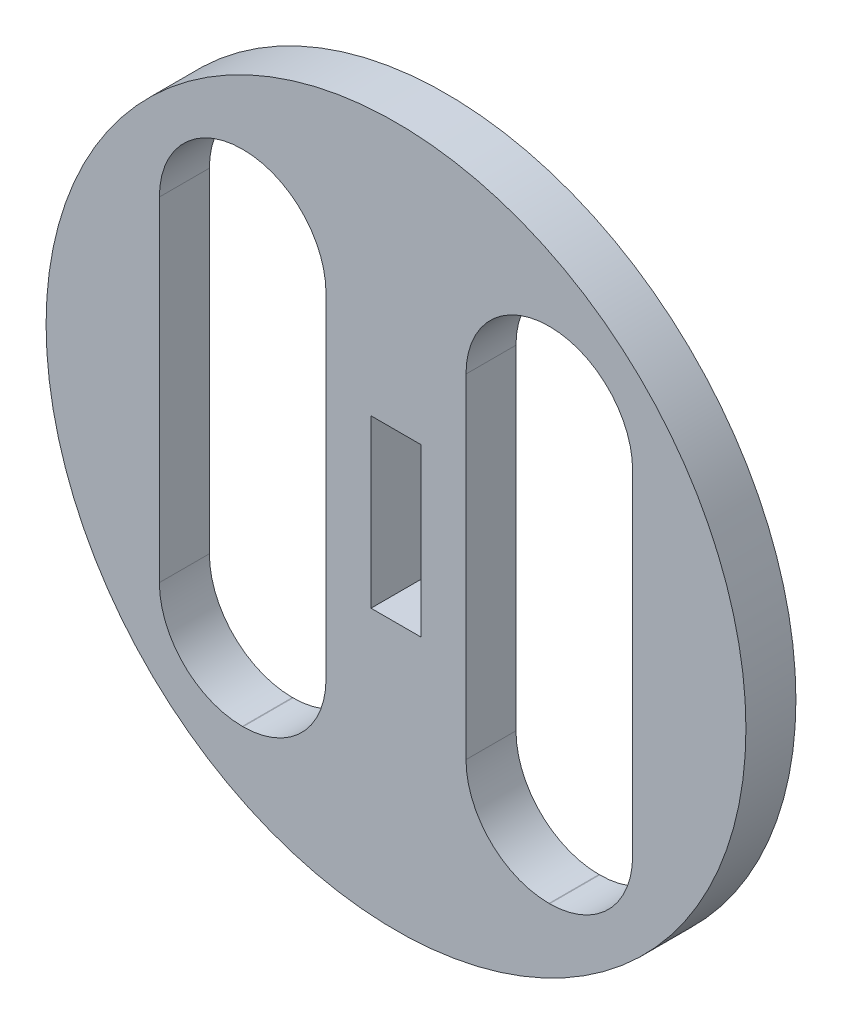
from build123d import *

# Parameters (mm, degrees)
SKETCH1_R          = 26.67
EXTRUDE1_DEPTH     = 3.81
CUT_EXTRUDE1_DEPTH = 38.909021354
SKETCH3_W          = 3.81
SKETCH3_H          = 12.7
CUT_EXTRUDE2_DEPTH = 38.909021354


with BuildPart() as part:
    # Sketch1 → Extrude1 (new body)
    with BuildSketch(Plane.XY):
        with Locations(Location((0, 0, 0), (0, 0, 180))):
            Circle(SKETCH1_R)
    extrude(amount=EXTRUDE1_DEPTH)

    # Sketch2 → Cut-Extrude1 (cut, through all)
    with BuildSketch(Plane.XY):
        with BuildLine():
            Line((-11.7094, 19.05), (-11.6586, 19.05))
            ThreePointArc((-11.6586, 19.05), (-7.186432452, 17.197567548), (-5.334, 12.7254))
            Line((-5.334, 12.7254), (-5.334, -12.7254))
            ThreePointArc((-5.334, -12.7254), (-7.186432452, -17.197567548), (-11.6586, -19.05))
            Line((-11.6586, -19.05), (-11.7094, -19.05))
            ThreePointArc((-11.7094, -19.05), (-16.181567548, -17.197567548), (-18.034, -12.7254))
            Line((-18.034, -12.7254), (-18.034, 12.7254))
            ThreePointArc((-18.034, 12.7254), (-16.181567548, 17.197567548), (-11.7094, 19.05))
        make_face()
        with BuildLine():
            Line((11.6586, 19.05), (11.7094, 19.05))
            ThreePointArc((11.7094, 19.05), (16.181567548, 17.197567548), (18.034, 12.7254))
            Line((18.034, 12.7254), (18.034, -12.7254))
            ThreePointArc((18.034, -12.7254), (16.181567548, -17.197567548), (11.7094, -19.05))
            Line((11.7094, -19.05), (11.6586, -19.05))
            ThreePointArc((11.6586, -19.05), (7.186432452, -17.197567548), (5.334, -12.7254))
            Line((5.334, -12.7254), (5.334, 12.7254))
            ThreePointArc((5.334, 12.7254), (7.186432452, 17.197567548), (11.6586, 19.05))
        make_face()
    extrude(amount=CUT_EXTRUDE1_DEPTH, mode=Mode.SUBTRACT)

    # Sketch3 → Cut-Extrude2 (cut, through all)
    with BuildSketch(Plane.XY):
        Rectangle(SKETCH3_W, SKETCH3_H)
    extrude(amount=CUT_EXTRUDE2_DEPTH, mode=Mode.SUBTRACT)


solid = part.part
